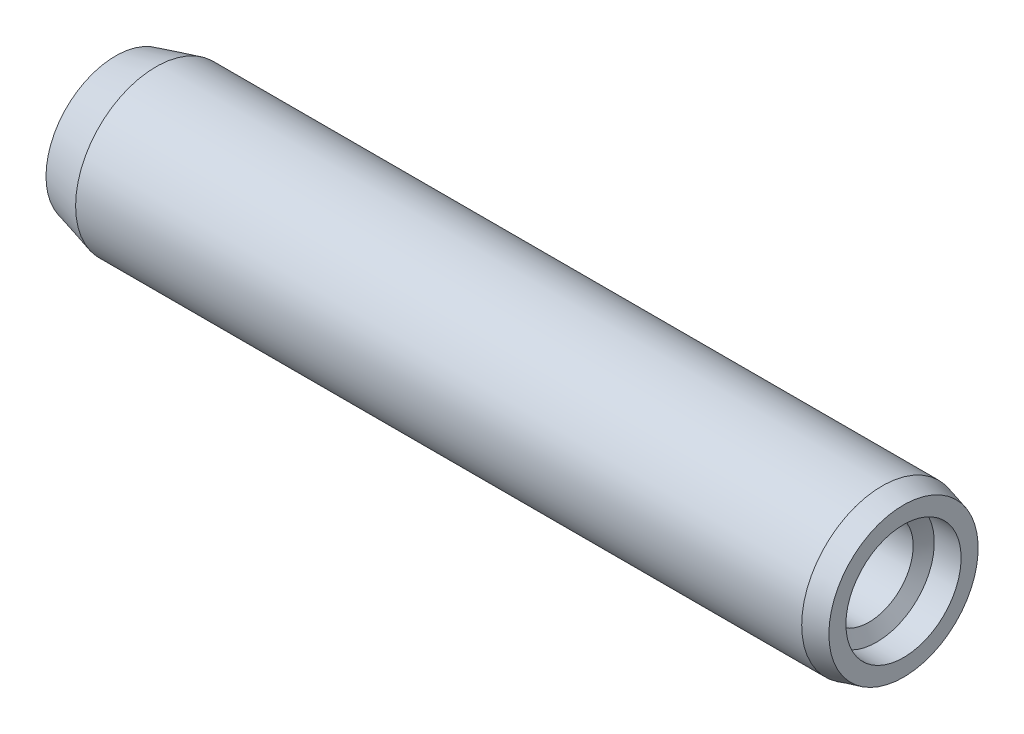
ISO-10303-21;
HEADER;
FILE_DESCRIPTION(('STEP AP214'),'2;1');
FILE_NAME('part.step','',(''),(''),'','','');
FILE_SCHEMA(('AUTOMOTIVE_DESIGN { 1 0 10303 214 1 1 1 1 }'));
ENDSEC;
DATA;
#1=APPLICATION_CONTEXT('core data for automotive mechanical design processes');
#2=APPLICATION_PROTOCOL_DEFINITION('international standard','automotive_design',2000,#1);
#3=PRODUCT_CONTEXT('',#1,'mechanical');
#4=PRODUCT('Part','Part','',(#3));
#5=PRODUCT_RELATED_PRODUCT_CATEGORY('part','',(#4));
#6=PRODUCT_DEFINITION_FORMATION('','',#4);
#7=PRODUCT_DEFINITION_CONTEXT('part definition',#1,'design');
#8=PRODUCT_DEFINITION('design','',#6,#7);
#9=PRODUCT_DEFINITION_SHAPE('','',#8);
#10=(LENGTH_UNIT() NAMED_UNIT(*) SI_UNIT(.MILLI.,.METRE.));
#11=(NAMED_UNIT(*) PLANE_ANGLE_UNIT() SI_UNIT($,.RADIAN.));
#12=(NAMED_UNIT(*) SI_UNIT($,.STERADIAN.) SOLID_ANGLE_UNIT());
#13=UNCERTAINTY_MEASURE_WITH_UNIT(LENGTH_MEASURE(1.E-05),#10,'distance_accuracy_value','');
#14=(GEOMETRIC_REPRESENTATION_CONTEXT(3) GLOBAL_UNCERTAINTY_ASSIGNED_CONTEXT((#13)) GLOBAL_UNIT_ASSIGNED_CONTEXT((#10,
#11,#12)) REPRESENTATION_CONTEXT('',''));
#15=CARTESIAN_POINT('',(0.,0.,0.));
#16=DIRECTION('',(0.,0.,1.));
#17=DIRECTION('',(1.,0.,0.));
#18=AXIS2_PLACEMENT_3D('',#15,#16,#17);
#19=CARTESIAN_POINT('',(2.1,0.,0.));
#20=DIRECTION('',(1.,0.,0.));
#21=DIRECTION('',(0.,0.,-1.));
#22=AXIS2_PLACEMENT_3D('',#19,#20,#21);
#23=CONICAL_SURFACE('',#22,3.,0.261799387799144);
#24=CARTESIAN_POINT('',(2.1,0.,0.));
#25=DIRECTION('',(-1.,0.,0.));
#26=DIRECTION('',(0.,0.,1.));
#27=AXIS2_PLACEMENT_3D('',#24,#25,#26);
#28=CIRCLE('',#27,3.);
#29=CARTESIAN_POINT('',(2.1,0.,3.));
#30=VERTEX_POINT('',#29);
#31=EDGE_CURVE('E57',#30,#30,#28,.T.);
#32=ORIENTED_EDGE('',*,*,#31,.T.);
#33=EDGE_LOOP('',(#32));
#34=FACE_BOUND('',#33,.T.);
#35=CARTESIAN_POINT('',(0.590443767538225,0.,0.));
#36=DIRECTION('',(-1.,0.,0.));
#37=DIRECTION('',(0.,0.,1.));
#38=AXIS2_PLACEMENT_3D('',#35,#36,#37);
#39=CIRCLE('',#38,2.59551562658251);
#40=CARTESIAN_POINT('',(0.590443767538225,0.,2.59551562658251));
#41=VERTEX_POINT('',#40);
#42=EDGE_CURVE('E55',#41,#41,#39,.T.);
#43=ORIENTED_EDGE('',*,*,#42,.F.);
#44=EDGE_LOOP('',(#43));
#45=FACE_BOUND('',#44,.T.);
#46=ADVANCED_FACE('F34',(#34,#45),#23,.T.);
#47=CARTESIAN_POINT('',(19.0085799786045,0.,0.));
#48=DIRECTION('',(1.,0.,0.));
#49=DIRECTION('',(0.,0.,-1.));
#50=AXIS2_PLACEMENT_3D('',#47,#48,#49);
#51=CONICAL_SURFACE('',#50,0.,1.02974425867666);
#52=CARTESIAN_POINT('',(20.,0.,0.));
#53=DIRECTION('',(-1.,0.,0.));
#54=DIRECTION('',(0.,0.,1.));
#55=AXIS2_PLACEMENT_3D('',#52,#53,#54);
#56=CIRCLE('',#55,1.65);
#57=CARTESIAN_POINT('',(20.,0.,1.65));
#58=VERTEX_POINT('',#57);
#59=EDGE_CURVE('E11',#58,#58,#56,.T.);
#60=ORIENTED_EDGE('',*,*,#59,.F.);
#61=EDGE_LOOP('',(#60));
#62=FACE_BOUND('',#61,.T.);
#63=CARTESIAN_POINT('',(19.0085799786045,0.,0.));
#64=VERTEX_POINT('',#63);
#65=VERTEX_LOOP('',#64);
#66=FACE_BOUND('',#65,.T.);
#67=ADVANCED_FACE('F36',(#62,#66),#51,.F.);
#68=CARTESIAN_POINT('',(-10.,0.,0.));
#69=DIRECTION('',(-1.,0.,0.));
#70=DIRECTION('',(0.,0.,1.));
#71=AXIS2_PLACEMENT_3D('',#68,#69,#70);
#72=CYLINDRICAL_SURFACE('',#71,1.65);
#73=CARTESIAN_POINT('',(28.7113248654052,0.,0.));
#74=DIRECTION('',(-1.,0.,0.));
#75=DIRECTION('',(0.,0.,1.));
#76=AXIS2_PLACEMENT_3D('',#73,#74,#75);
#77=CIRCLE('',#76,1.65);
#78=CARTESIAN_POINT('',(28.7113248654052,0.,1.65));
#79=VERTEX_POINT('',#78);
#80=EDGE_CURVE('E42',#79,#79,#77,.T.);
#81=ORIENTED_EDGE('',*,*,#80,.F.);
#82=EDGE_LOOP('',(#81));
#83=FACE_BOUND('',#82,.T.);
#84=ORIENTED_EDGE('',*,*,#59,.T.);
#85=EDGE_LOOP('',(#84));
#86=FACE_BOUND('',#85,.T.);
#87=ADVANCED_FACE('F78',(#83,#86),#72,.F.);
#88=CARTESIAN_POINT('',(28.7113248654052,0.,0.));
#89=DIRECTION('',(1.,0.,0.));
#90=DIRECTION('',(0.,0.,-1.));
#91=AXIS2_PLACEMENT_3D('',#88,#89,#90);
#92=CONICAL_SURFACE('',#91,1.65,1.0471975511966);
#93=CARTESIAN_POINT('',(29.,0.,0.));
#94=DIRECTION('',(-1.,0.,0.));
#95=DIRECTION('',(0.,0.,1.));
#96=AXIS2_PLACEMENT_3D('',#93,#94,#95);
#97=CIRCLE('',#96,2.15);
#98=CARTESIAN_POINT('',(29.,0.,2.15));
#99=VERTEX_POINT('',#98);
#100=EDGE_CURVE('E71',#99,#99,#97,.T.);
#101=ORIENTED_EDGE('',*,*,#100,.F.);
#102=EDGE_LOOP('',(#101));
#103=FACE_BOUND('',#102,.T.);
#104=ORIENTED_EDGE('',*,*,#80,.T.);
#105=EDGE_LOOP('',(#104));
#106=FACE_BOUND('',#105,.T.);
#107=ADVANCED_FACE('F76',(#103,#106),#92,.F.);
#108=CARTESIAN_POINT('',(-10.,0.,0.));
#109=DIRECTION('',(-1.,0.,0.));
#110=DIRECTION('',(0.,0.,1.));
#111=AXIS2_PLACEMENT_3D('',#108,#109,#110);
#112=CYLINDRICAL_SURFACE('',#111,2.15);
#113=CARTESIAN_POINT('',(30.,0.,0.));
#114=DIRECTION('',(-1.,0.,0.));
#115=DIRECTION('',(0.,0.,1.));
#116=AXIS2_PLACEMENT_3D('',#113,#114,#115);
#117=CIRCLE('',#116,2.15);
#118=CARTESIAN_POINT('',(30.,0.,2.15));
#119=VERTEX_POINT('',#118);
#120=EDGE_CURVE('E68',#119,#119,#117,.T.);
#121=ORIENTED_EDGE('',*,*,#120,.F.);
#122=EDGE_LOOP('',(#121));
#123=FACE_BOUND('',#122,.T.);
#124=ORIENTED_EDGE('',*,*,#100,.T.);
#125=EDGE_LOOP('',(#124));
#126=FACE_BOUND('',#125,.T.);
#127=ADVANCED_FACE('F102',(#123,#126),#112,.F.);
#128=CARTESIAN_POINT('',(30.,2.7856406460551,0.));
#129=DIRECTION('',(-1.,0.,0.));
#130=DIRECTION('',(0.,0.,1.));
#131=AXIS2_PLACEMENT_3D('',#128,#129,#130);
#132=PLANE('',#131);
#133=CARTESIAN_POINT('',(30.,0.,0.));
#134=DIRECTION('',(-1.,0.,0.));
#135=DIRECTION('',(0.,0.,1.));
#136=AXIS2_PLACEMENT_3D('',#133,#134,#135);
#137=CIRCLE('',#136,2.7856406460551);
#138=CARTESIAN_POINT('',(30.,0.,2.7856406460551));
#139=VERTEX_POINT('',#138);
#140=EDGE_CURVE('E65',#139,#139,#137,.T.);
#141=ORIENTED_EDGE('',*,*,#140,.F.);
#142=EDGE_LOOP('',(#141));
#143=FACE_BOUND('',#142,.T.);
#144=ORIENTED_EDGE('',*,*,#120,.T.);
#145=EDGE_LOOP('',(#144));
#146=FACE_BOUND('',#145,.T.);
#147=ADVANCED_FACE('F98',(#143,#146),#132,.F.);
#148=CARTESIAN_POINT('',(30.,0.,0.));
#149=DIRECTION('',(-1.,0.,0.));
#150=DIRECTION('',(0.,0.,1.));
#151=AXIS2_PLACEMENT_3D('',#148,#149,#150);
#152=CONICAL_SURFACE('',#151,2.7856406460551,0.261799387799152);
#153=CARTESIAN_POINT('',(29.2,0.,0.));
#154=DIRECTION('',(-1.,0.,0.));
#155=DIRECTION('',(0.,0.,1.));
#156=AXIS2_PLACEMENT_3D('',#153,#154,#155);
#157=CIRCLE('',#156,3.);
#158=CARTESIAN_POINT('',(29.2,0.,3.));
#159=VERTEX_POINT('',#158);
#160=EDGE_CURVE('E60',#159,#159,#157,.T.);
#161=ORIENTED_EDGE('',*,*,#160,.F.);
#162=EDGE_LOOP('',(#161));
#163=FACE_BOUND('',#162,.T.);
#164=ORIENTED_EDGE('',*,*,#140,.T.);
#165=EDGE_LOOP('',(#164));
#166=FACE_BOUND('',#165,.T.);
#167=ADVANCED_FACE('F94',(#163,#166),#152,.T.);
#168=CARTESIAN_POINT('',(-10.,0.,0.));
#169=DIRECTION('',(-1.,0.,0.));
#170=DIRECTION('',(0.,0.,1.));
#171=AXIS2_PLACEMENT_3D('',#168,#169,#170);
#172=CYLINDRICAL_SURFACE('',#171,3.);
#173=ORIENTED_EDGE('',*,*,#31,.F.);
#174=EDGE_LOOP('',(#173));
#175=FACE_BOUND('',#174,.T.);
#176=ORIENTED_EDGE('',*,*,#160,.T.);
#177=EDGE_LOOP('',(#176));
#178=FACE_BOUND('',#177,.T.);
#179=ADVANCED_FACE('F51',(#175,#178),#172,.T.);
#180=CARTESIAN_POINT('',(6.,0.,0.));
#181=DIRECTION('',(-1.,0.,0.));
#182=DIRECTION('',(0.,-1.,0.));
#183=AXIS2_PLACEMENT_3D('',#180,#181,#182);
#184=SPHERICAL_SURFACE('',#183,6.);
#185=CARTESIAN_POINT('',(0.,0.,0.));
#186=VERTEX_POINT('',#185);
#187=VERTEX_LOOP('',#186);
#188=FACE_BOUND('',#187,.T.);
#189=ORIENTED_EDGE('',*,*,#42,.T.);
#190=EDGE_LOOP('',(#189));
#191=FACE_BOUND('',#190,.T.);
#192=ADVANCED_FACE('F48',(#188,#191),#184,.T.);
#193=CLOSED_SHELL('',(#46,#67,#87,#107,#127,#147,#167,#179,#192));
#194=MANIFOLD_SOLID_BREP('B2',#193);
#195=ADVANCED_BREP_SHAPE_REPRESENTATION('',(#18,#194),#14);
#196=SHAPE_DEFINITION_REPRESENTATION(#9,#195);
ENDSEC;
END-ISO-10303-21;
